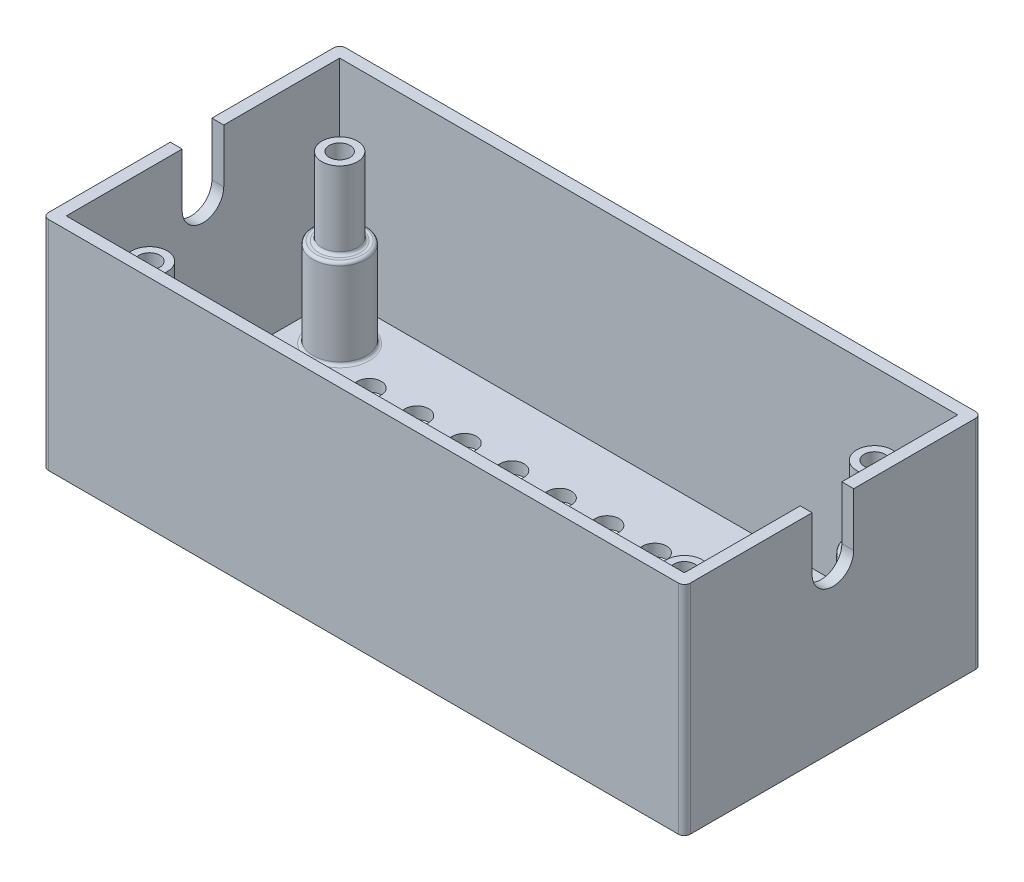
from build123d import *

# Parameters (mm, degrees)
SKETCH_1_W          = 108
SKETCH_1_H          = 50
EXTRUDE_1_DEPTH     = 2
SKETCH_2_W          = 108
SKETCH_2_H          = 50
SKETCH_2_W_2        = 104
SKETCH_2_H_2        = 46
EXTRUDE_2_DEPTH     = 34.6
SKETCH_3_R          = 3
EXTRUDE_3_DEPTH     = 28
SKETCH_4_R          = 1.75
CUT_EXTRUDE_1_DEPTH = 67.640828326
SKETCH_5_R          = 2.95
CUT_EXTRUDE_2_DEPTH = 15
SKETCH_6_R          = 4.5
SKETCH_6_R_2        = 3
EXTRUDE_4_DEPTH     = 15
CUT_EXTRUDE_3_DEPTH = 117.741423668
CUT_EXTRUDE_4_REACH = 71.861
SKETCH_9_W          = 22
SKETCH_9_H          = 16
CUT_EXTRUDE_5_DEPTH = 0.5
SKETCH_10_W         = 20
SKETCH_10_H         = 14
CUT_EXTRUDE_6_DEPTH = 1
FILLET_1_R          = 0.5
EXTRUDE_START       = -0.5
SKETCH_11_R         = 1.75
SKETCH_11_R_2       = 1.769150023
EXTRUDE_5_DEPTH     = 0.5
FILLET_2_R          = 1


with BuildPart() as part:
    # Sketch 1 → Extrude 1 (new body)
    with BuildSketch(Plane(origin=(0, 0, 0), x_dir=(1, 0, 0), z_dir=(0, 1, 0))):
        Rectangle(SKETCH_1_W, SKETCH_1_H)
    extrude(amount=EXTRUDE_1_DEPTH)

    # Sketch 2 → Extrude 2 (add)
    with BuildSketch(Plane(origin=(0, 2, 0), x_dir=(1, 0, 0), z_dir=(0, 1, 0))):
        Rectangle(SKETCH_2_W, SKETCH_2_H)
        Rectangle(SKETCH_2_W_2, SKETCH_2_H_2, mode=Mode.SUBTRACT)
    extrude(amount=EXTRUDE_2_DEPTH)

    # Sketch 3 → Extrude 3 (add)
    with BuildSketch(Plane(origin=(0, 2, 0), x_dir=(1, 0, 0), z_dir=(0, 1, 0))):
        with Locations(Location((-45, 16, 0), (0, 0, 270))):
            Circle(SKETCH_3_R)
        with Locations(Location((45, 16, 0), (0, 0, 270))):
            Circle(SKETCH_3_R)
        with Locations(Location((45, -16, 0), (0, 0, 270))):
            Circle(SKETCH_3_R)
        with Locations(Location((-45, -16, 0), (0, 0, 270))):
            Circle(SKETCH_3_R)
    extrude(amount=EXTRUDE_3_DEPTH)

    # Sketch 4 → Cut-Extrude 1 (cut, through all)
    with BuildSketch(Plane(origin=(0, 30, 0), x_dir=(1, 0, 0), z_dir=(0, 1, 0))):
        with Locations(Location((-45, 16, 0), (0, 0, 270))):
            Circle(SKETCH_4_R)
        with Locations(Location((45, 16, 0), (0, 0, 270))):
            Circle(SKETCH_4_R)
        with Locations(Location((45, -16, 0), (0, 0, 270))):
            Circle(SKETCH_4_R)
        with Locations(Location((-45, -16, 0), (0, 0, 270))):
            Circle(SKETCH_4_R)
    extrude(amount=-CUT_EXTRUDE_1_DEPTH, mode=Mode.SUBTRACT)

    # Sketch 5 → Cut-Extrude 2 (cut)
    with BuildSketch(Plane.XZ):
        with Locations(Location((-45, 16, 0), (0, 0, 270))):
            Circle(SKETCH_5_R)
        with Locations(Location((-45, -16, 0), (0, 0, 270))):
            Circle(SKETCH_5_R)
        with Locations(Location((45, -16, 0), (0, 0, 270))):
            Circle(SKETCH_5_R)
        with Locations(Location((45, 16, 0), (0, 0, 270))):
            Circle(SKETCH_5_R)
    extrude(amount=-CUT_EXTRUDE_2_DEPTH, mode=Mode.SUBTRACT)

    # Sketch 6 → Extrude 4 (add)
    # profile 1 of 4: a face of its own
    with BuildSketch(Plane(origin=(0, 2, 0), x_dir=(1, 0, 0), z_dir=(0, 1, 0))):
        with Locations(Location((-45, 16, 0), (0, 0, 270))):
            Circle(SKETCH_6_R)
        with Locations(Location((-45, 16, 0), (0, 0, 270))):
            Circle(SKETCH_6_R_2, mode=Mode.SUBTRACT)
    # profile 2 of 4: a face of its own
    with BuildSketch(Plane(origin=(0, 2, 0), x_dir=(1, 0, 0), z_dir=(0, 1, 0))):
        with Locations(Location((45, 16, 0), (0, 0, 270))):
            Circle(SKETCH_6_R)
        with Locations(Location((45, 16, 0), (0, 0, 270))):
            Circle(SKETCH_6_R_2, mode=Mode.SUBTRACT)
    # profile 3 of 4: a face of its own
    with BuildSketch(Plane(origin=(0, 2, 0), x_dir=(1, 0, 0), z_dir=(0, 1, 0))):
        with Locations(Location((45, -16, 0), (0, 0, 270))):
            Circle(SKETCH_6_R)
        with Locations(Location((45, -16, 0), (0, 0, 270))):
            Circle(SKETCH_6_R_2, mode=Mode.SUBTRACT)
    # profile 4 of 4: a face of its own
    with BuildSketch(Plane(origin=(0, 2, 0), x_dir=(1, 0, 0), z_dir=(0, 1, 0))):
        with Locations(Location((-45, -16, 0), (0, 0, 270))):
            Circle(SKETCH_6_R)
        with Locations(Location((-45, -16, 0), (0, 0, 270))):
            Circle(SKETCH_6_R_2, mode=Mode.SUBTRACT)
    extrude(amount=EXTRUDE_4_DEPTH)

    # Sketch 7 → Cut-Extrude 3 (cut, through all)
    with BuildSketch(Plane.ZY.offset(54)):
        with BuildLine():
            Line((-3.5, 36.6), (3.5, 36.6))
            Line((3.5, 36.6), (3.5, 27.6))
            ThreePointArc((3.5, 27.6), (0, 24.1), (-3.5, 27.6))
            Line((-3.5, 27.6), (-3.5, 36.6))
        make_face()
    extrude(amount=-CUT_EXTRUDE_3_DEPTH, mode=Mode.SUBTRACT)

    # Sketch 8 → Cut-Extrude 4 (cut, up to next)
    with BuildSketch(Plane.XZ, mode=Mode.PRIVATE) as cut_extrude_4_sk1:
        with BuildLine():
            Line((-6, 4), (-6, 12))
            ThreePointArc((-6, 12), (-4, 14), (-2, 12))
            Line((-2, 12), (-2, 4))
            ThreePointArc((-2, 4), (-4, 2), (-6, 4))
        make_face()
    cut_extrude_4_tool1 = extrude(cut_extrude_4_sk1.sketch, amount=-CUT_EXTRUDE_4_REACH, mode=Mode.PRIVATE) & part.part
    # Sketch 8 → Cut-Extrude 4 (cut, up to next)
    with BuildSketch(Plane.XZ, mode=Mode.PRIVATE) as cut_extrude_4_sk2:
        with BuildLine():
            Line((-14, 4), (-14, 12))
            ThreePointArc((-14, 12), (-12, 14), (-10, 12))
            Line((-10, 12), (-10, 4))
            ThreePointArc((-10, 4), (-12, 2), (-14, 4))
        make_face()
    cut_extrude_4_tool2 = extrude(cut_extrude_4_sk2.sketch, amount=-CUT_EXTRUDE_4_REACH, mode=Mode.PRIVATE) & part.part
    # Sketch 8 → Cut-Extrude 4 (cut, up to next)
    with BuildSketch(Plane.XZ, mode=Mode.PRIVATE) as cut_extrude_4_sk3:
        with BuildLine():
            Line((-22, 4), (-22, 12))
            ThreePointArc((-22, 12), (-20, 14), (-18, 12))
            Line((-18, 12), (-18, 4))
            ThreePointArc((-18, 4), (-20, 2), (-22, 4))
        make_face()
    cut_extrude_4_tool3 = extrude(cut_extrude_4_sk3.sketch, amount=-CUT_EXTRUDE_4_REACH, mode=Mode.PRIVATE) & part.part
    # Sketch 8 → Cut-Extrude 4 (cut, up to next)
    with BuildSketch(Plane.XZ, mode=Mode.PRIVATE) as cut_extrude_4_sk4:
        with BuildLine():
            Line((-30, 4), (-30, 12))
            ThreePointArc((-30, 12), (-28, 14), (-26, 12))
            Line((-26, 12), (-26, 4))
            ThreePointArc((-26, 4), (-28, 2), (-30, 4))
        make_face()
    cut_extrude_4_tool4 = extrude(cut_extrude_4_sk4.sketch, amount=-CUT_EXTRUDE_4_REACH, mode=Mode.PRIVATE) & part.part
    # Sketch 8 → Cut-Extrude 4 (cut, up to next)
    with BuildSketch(Plane.XZ, mode=Mode.PRIVATE) as cut_extrude_4_sk5:
        with BuildLine():
            Line((-38, 4), (-38, 12))
            ThreePointArc((-38, 12), (-36, 14), (-34, 12))
            Line((-34, 12), (-34, 4))
            ThreePointArc((-34, 4), (-36, 2), (-38, 4))
        make_face()
    cut_extrude_4_tool5 = extrude(cut_extrude_4_sk5.sketch, amount=-CUT_EXTRUDE_4_REACH, mode=Mode.PRIVATE) & part.part
    # Sketch 8 → Cut-Extrude 4 (cut, up to next)
    with BuildSketch(Plane.XZ, mode=Mode.PRIVATE) as cut_extrude_4_sk6:
        with BuildLine():
            Line((-14, -12), (-14, -4))
            ThreePointArc((-14, -4), (-12, -2), (-10, -4))
            Line((-10, -4), (-10, -12))
            ThreePointArc((-10, -12), (-12, -14), (-14, -12))
        make_face()
    cut_extrude_4_tool6 = extrude(cut_extrude_4_sk6.sketch, amount=-CUT_EXTRUDE_4_REACH, mode=Mode.PRIVATE) & part.part
    # Sketch 8 → Cut-Extrude 4 (cut, up to next)
    with BuildSketch(Plane.XZ, mode=Mode.PRIVATE) as cut_extrude_4_sk7:
        with BuildLine():
            Line((-22, -12), (-22, -4))
            ThreePointArc((-22, -4), (-20, -2), (-18, -4))
            Line((-18, -4), (-18, -12))
            ThreePointArc((-18, -12), (-20, -14), (-22, -12))
        make_face()
    cut_extrude_4_tool7 = extrude(cut_extrude_4_sk7.sketch, amount=-CUT_EXTRUDE_4_REACH, mode=Mode.PRIVATE) & part.part
    # Sketch 8 → Cut-Extrude 4 (cut, up to next)
    with BuildSketch(Plane.XZ, mode=Mode.PRIVATE) as cut_extrude_4_sk8:
        with BuildLine():
            Line((-30, -12), (-30, -4))
            ThreePointArc((-30, -4), (-28, -2), (-26, -4))
            Line((-26, -4), (-26, -12))
            ThreePointArc((-26, -12), (-28, -14), (-30, -12))
        make_face()
    cut_extrude_4_tool8 = extrude(cut_extrude_4_sk8.sketch, amount=-CUT_EXTRUDE_4_REACH, mode=Mode.PRIVATE) & part.part
    # Sketch 8 → Cut-Extrude 4 (cut, up to next)
    with BuildSketch(Plane.XZ, mode=Mode.PRIVATE) as cut_extrude_4_sk9:
        with BuildLine():
            Line((-38, -12), (-38, -4))
            ThreePointArc((-38, -4), (-36, -2), (-34, -4))
            Line((-34, -4), (-34, -12))
            ThreePointArc((-34, -12), (-36, -14), (-38, -12))
        make_face()
    cut_extrude_4_tool9 = extrude(cut_extrude_4_sk9.sketch, amount=-CUT_EXTRUDE_4_REACH, mode=Mode.PRIVATE) & part.part
    # Sketch 8 → Cut-Extrude 4 (cut, up to next)
    with BuildSketch(Plane.XZ, mode=Mode.PRIVATE) as cut_extrude_4_sk10:
        with BuildLine():
            Line((-6, -12), (-6, -4))
            ThreePointArc((-6, -4), (-4, -2), (-2, -4))
            Line((-2, -4), (-2, -12))
            ThreePointArc((-2, -12), (-4, -14), (-6, -12))
        make_face()
    cut_extrude_4_tool10 = extrude(cut_extrude_4_sk10.sketch, amount=-CUT_EXTRUDE_4_REACH, mode=Mode.PRIVATE) & part.part
    # Sketch 8 → Cut-Extrude 4 (cut, up to next)
    with BuildSketch(Plane.XZ, mode=Mode.PRIVATE) as cut_extrude_4_sk11:
        with BuildLine():
            Line((6, -12), (6, -4))
            ThreePointArc((6, -4), (4, -2), (2, -4))
            Line((2, -4), (2, -12))
            ThreePointArc((2, -12), (4, -14), (6, -12))
        make_face()
    cut_extrude_4_tool11 = extrude(cut_extrude_4_sk11.sketch, amount=-CUT_EXTRUDE_4_REACH, mode=Mode.PRIVATE) & part.part
    # Sketch 8 → Cut-Extrude 4 (cut, up to next)
    with BuildSketch(Plane.XZ, mode=Mode.PRIVATE) as cut_extrude_4_sk12:
        with BuildLine():
            Line((38, -12), (38, -4))
            ThreePointArc((38, -4), (36, -2), (34, -4))
            Line((34, -4), (34, -12))
            ThreePointArc((34, -12), (36, -14), (38, -12))
        make_face()
    cut_extrude_4_tool12 = extrude(cut_extrude_4_sk12.sketch, amount=-CUT_EXTRUDE_4_REACH, mode=Mode.PRIVATE) & part.part
    # Sketch 8 → Cut-Extrude 4 (cut, up to next)
    with BuildSketch(Plane.XZ, mode=Mode.PRIVATE) as cut_extrude_4_sk13:
        with BuildLine():
            Line((30, -12), (30, -4))
            ThreePointArc((30, -4), (28, -2), (26, -4))
            Line((26, -4), (26, -12))
            ThreePointArc((26, -12), (28, -14), (30, -12))
        make_face()
    cut_extrude_4_tool13 = extrude(cut_extrude_4_sk13.sketch, amount=-CUT_EXTRUDE_4_REACH, mode=Mode.PRIVATE) & part.part
    # Sketch 8 → Cut-Extrude 4 (cut, up to next)
    with BuildSketch(Plane.XZ, mode=Mode.PRIVATE) as cut_extrude_4_sk14:
        with BuildLine():
            Line((22, -12), (22, -4))
            ThreePointArc((22, -4), (20, -2), (18, -4))
            Line((18, -4), (18, -12))
            ThreePointArc((18, -12), (20, -14), (22, -12))
        make_face()
    cut_extrude_4_tool14 = extrude(cut_extrude_4_sk14.sketch, amount=-CUT_EXTRUDE_4_REACH, mode=Mode.PRIVATE) & part.part
    # Sketch 8 → Cut-Extrude 4 (cut, up to next)
    with BuildSketch(Plane.XZ, mode=Mode.PRIVATE) as cut_extrude_4_sk15:
        with BuildLine():
            Line((14, -12), (14, -4))
            ThreePointArc((14, -4), (12, -2), (10, -4))
            Line((10, -4), (10, -12))
            ThreePointArc((10, -12), (12, -14), (14, -12))
        make_face()
    cut_extrude_4_tool15 = extrude(cut_extrude_4_sk15.sketch, amount=-CUT_EXTRUDE_4_REACH, mode=Mode.PRIVATE) & part.part
    # Sketch 8 → Cut-Extrude 4 (cut, up to next)
    with BuildSketch(Plane.XZ, mode=Mode.PRIVATE) as cut_extrude_4_sk16:
        with BuildLine():
            Line((38, 4), (38, 12))
            ThreePointArc((38, 12), (36, 14), (34, 12))
            Line((34, 12), (34, 4))
            ThreePointArc((34, 4), (36, 2), (38, 4))
        make_face()
    cut_extrude_4_tool16 = extrude(cut_extrude_4_sk16.sketch, amount=-CUT_EXTRUDE_4_REACH, mode=Mode.PRIVATE) & part.part
    # Sketch 8 → Cut-Extrude 4 (cut, up to next)
    with BuildSketch(Plane.XZ, mode=Mode.PRIVATE) as cut_extrude_4_sk17:
        with BuildLine():
            Line((30, 4), (30, 12))
            ThreePointArc((30, 12), (28, 14), (26, 12))
            Line((26, 12), (26, 4))
            ThreePointArc((26, 4), (28, 2), (30, 4))
        make_face()
    cut_extrude_4_tool17 = extrude(cut_extrude_4_sk17.sketch, amount=-CUT_EXTRUDE_4_REACH, mode=Mode.PRIVATE) & part.part
    # Sketch 8 → Cut-Extrude 4 (cut, up to next)
    with BuildSketch(Plane.XZ, mode=Mode.PRIVATE) as cut_extrude_4_sk18:
        with BuildLine():
            Line((22, 4), (22, 12))
            ThreePointArc((22, 12), (20, 14), (18, 12))
            Line((18, 12), (18, 4))
            ThreePointArc((18, 4), (20, 2), (22, 4))
        make_face()
    cut_extrude_4_tool18 = extrude(cut_extrude_4_sk18.sketch, amount=-CUT_EXTRUDE_4_REACH, mode=Mode.PRIVATE) & part.part
    # Sketch 8 → Cut-Extrude 4 (cut, up to next)
    with BuildSketch(Plane.XZ, mode=Mode.PRIVATE) as cut_extrude_4_sk19:
        with BuildLine():
            Line((14, 4), (14, 12))
            ThreePointArc((14, 12), (12, 14), (10, 12))
            Line((10, 12), (10, 4))
            ThreePointArc((10, 4), (12, 2), (14, 4))
        make_face()
    cut_extrude_4_tool19 = extrude(cut_extrude_4_sk19.sketch, amount=-CUT_EXTRUDE_4_REACH, mode=Mode.PRIVATE) & part.part
    # Sketch 8 → Cut-Extrude 4 (cut, up to next)
    with BuildSketch(Plane.XZ, mode=Mode.PRIVATE) as cut_extrude_4_sk20:
        with BuildLine():
            Line((6, 4), (6, 12))
            ThreePointArc((6, 12), (4, 14), (2, 12))
            Line((2, 12), (2, 4))
            ThreePointArc((2, 4), (4, 2), (6, 4))
        make_face()
    cut_extrude_4_tool20 = extrude(cut_extrude_4_sk20.sketch, amount=-CUT_EXTRUDE_4_REACH, mode=Mode.PRIVATE) & part.part
    add(cut_extrude_4_tool1.solids().sort_by_distance((-4, 0, 8))[0], mode=Mode.SUBTRACT)
    add(cut_extrude_4_tool2.solids().sort_by_distance((-12, 0, 8))[0], mode=Mode.SUBTRACT)
    add(cut_extrude_4_tool3.solids().sort_by_distance((-20, 0, 8))[0], mode=Mode.SUBTRACT)
    add(cut_extrude_4_tool4.solids().sort_by_distance((-28, 0, 8))[0], mode=Mode.SUBTRACT)
    add(cut_extrude_4_tool5.solids().sort_by_distance((-36, 0, 8))[0], mode=Mode.SUBTRACT)
    add(cut_extrude_4_tool6.solids().sort_by_distance((-12, 0, -8))[0], mode=Mode.SUBTRACT)
    add(cut_extrude_4_tool7.solids().sort_by_distance((-20, 0, -8))[0], mode=Mode.SUBTRACT)
    add(cut_extrude_4_tool8.solids().sort_by_distance((-28, 0, -8))[0], mode=Mode.SUBTRACT)
    add(cut_extrude_4_tool9.solids().sort_by_distance((-36, 0, -8))[0], mode=Mode.SUBTRACT)
    add(cut_extrude_4_tool10.solids().sort_by_distance((-4, 0, -8))[0], mode=Mode.SUBTRACT)
    add(cut_extrude_4_tool11.solids().sort_by_distance((4, 0, -8))[0], mode=Mode.SUBTRACT)
    add(cut_extrude_4_tool12.solids().sort_by_distance((36, 0, -8))[0], mode=Mode.SUBTRACT)
    add(cut_extrude_4_tool13.solids().sort_by_distance((28, 0, -8))[0], mode=Mode.SUBTRACT)
    add(cut_extrude_4_tool14.solids().sort_by_distance((20, 0, -8))[0], mode=Mode.SUBTRACT)
    add(cut_extrude_4_tool15.solids().sort_by_distance((12, 0, -8))[0], mode=Mode.SUBTRACT)
    add(cut_extrude_4_tool16.solids().sort_by_distance((36, 0, 8))[0], mode=Mode.SUBTRACT)
    add(cut_extrude_4_tool17.solids().sort_by_distance((28, 0, 8))[0], mode=Mode.SUBTRACT)
    add(cut_extrude_4_tool18.solids().sort_by_distance((20, 0, 8))[0], mode=Mode.SUBTRACT)
    add(cut_extrude_4_tool19.solids().sort_by_distance((12, 0, 8))[0], mode=Mode.SUBTRACT)
    add(cut_extrude_4_tool20.solids().sort_by_distance((4, 0, 8))[0], mode=Mode.SUBTRACT)

    # Sketch 9 → Cut-Extrude 5 (cut)
    with BuildSketch(Plane.ZY.offset(54)):
        with Locations((0, 12.05)):
            Rectangle(SKETCH_9_W, SKETCH_9_H)
    extrude(amount=-CUT_EXTRUDE_5_DEPTH, mode=Mode.SUBTRACT)

    # Sketch 10 → Cut-Extrude 6 (cut)
    with BuildSketch(Plane.ZY.offset(53.5)):
        with Locations((0, 12.05)):
            Rectangle(SKETCH_10_W, SKETCH_10_H)
    extrude(amount=-CUT_EXTRUDE_6_DEPTH, mode=Mode.SUBTRACT)

    # Fillet 1
    fillet_1_edges = [part.edges().sort_by_distance(p)[0] for p in [
        (45, 17, -20.5),
        (45, 2, -20.5),
        (45, 17, -19),
        (45, 17, 11.5),
        (45, 2, 11.5),
        (45, 17, 13),
        (-45, 17, 11.5),
        (-45, 2, 11.5),
        (-45, 17, 13),
        (-45, 17, -20.5),
        (-45, 2, -20.5),
        (-45, 17, -19),
    ]]
    fillet(fillet_1_edges, radius=FILLET_1_R)

    # Sketch 11 → Extrude 5 (add)
    with BuildSketch(Plane.XZ.offset(-15).offset(EXTRUDE_START)):
        with Locations(Location((-45, 16, 0), (0, 0, 90))):
            Circle(SKETCH_11_R)
        with Locations(Location((45, 16, 0), (0, 0, 90))):
            Circle(SKETCH_11_R)
        with Locations(Location((45, -16, 0), (0, 0, 90))):
            Circle(SKETCH_11_R)
        with Locations((-45, -16)):
            Circle(SKETCH_11_R_2)
    extrude(amount=EXTRUDE_5_DEPTH)

    # Fillet 2
    fillet_2_edges = [part.edges().sort_by_distance(p)[0] for p in [
        (54, 18.3, 25),
        (-54, 18.3, 25),
        (-54, 18.3, -25),
        (54, 18.3, -25),
    ]]
    fillet(fillet_2_edges, radius=FILLET_2_R)


solid = part.part
